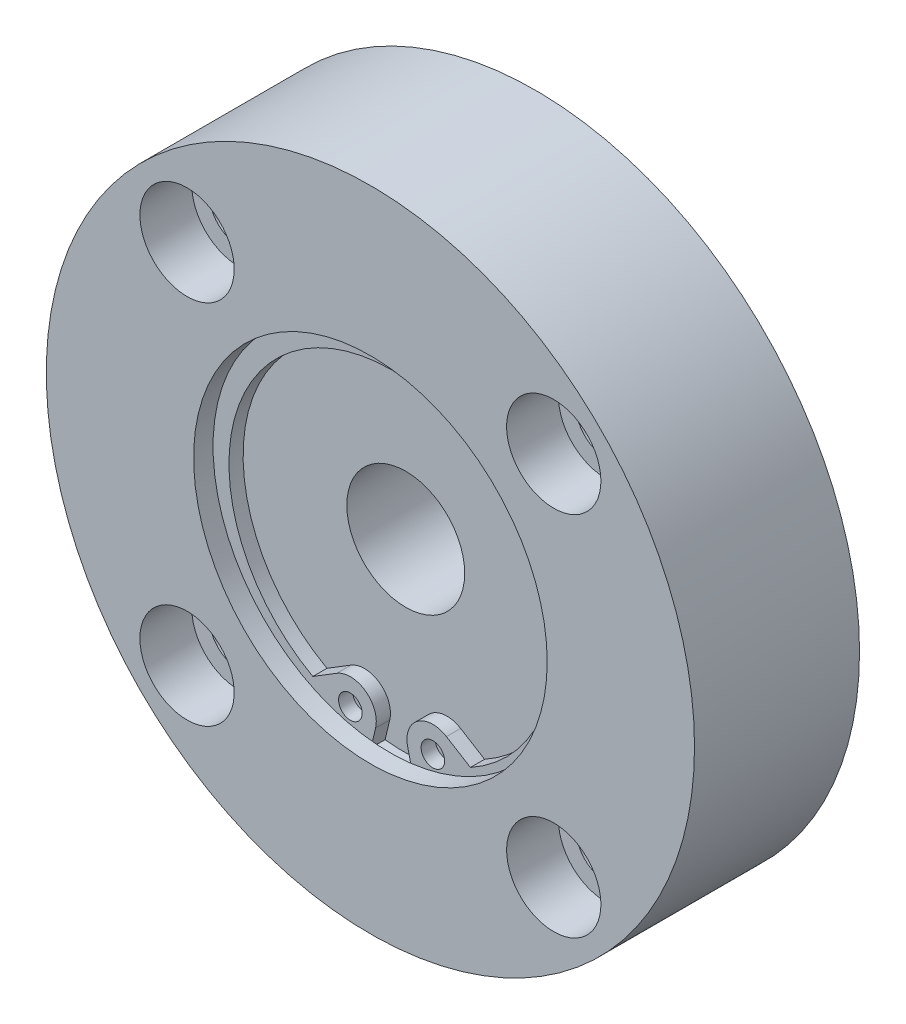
ISO-10303-21;
HEADER;
FILE_DESCRIPTION(('STEP AP214'),'2;1');
FILE_NAME('part.step','',(''),(''),'','','');
FILE_SCHEMA(('AUTOMOTIVE_DESIGN { 1 0 10303 214 1 1 1 1 }'));
ENDSEC;
DATA;
#1=APPLICATION_CONTEXT('core data for automotive mechanical design processes');
#2=APPLICATION_PROTOCOL_DEFINITION('international standard','automotive_design',2000,#1);
#3=PRODUCT_CONTEXT('',#1,'mechanical');
#4=PRODUCT('Part','Part','',(#3));
#5=PRODUCT_RELATED_PRODUCT_CATEGORY('part','',(#4));
#6=PRODUCT_DEFINITION_FORMATION('','',#4);
#7=PRODUCT_DEFINITION_CONTEXT('part definition',#1,'design');
#8=PRODUCT_DEFINITION('design','',#6,#7);
#9=PRODUCT_DEFINITION_SHAPE('','',#8);
#10=(LENGTH_UNIT() NAMED_UNIT(*) SI_UNIT(.MILLI.,.METRE.));
#11=(NAMED_UNIT(*) PLANE_ANGLE_UNIT() SI_UNIT($,.RADIAN.));
#12=(NAMED_UNIT(*) SI_UNIT($,.STERADIAN.) SOLID_ANGLE_UNIT());
#13=UNCERTAINTY_MEASURE_WITH_UNIT(LENGTH_MEASURE(1.E-05),#10,'distance_accuracy_value','');
#14=(GEOMETRIC_REPRESENTATION_CONTEXT(3) GLOBAL_UNCERTAINTY_ASSIGNED_CONTEXT((#13)) GLOBAL_UNIT_ASSIGNED_CONTEXT((#10,
#11,#12)) REPRESENTATION_CONTEXT('',''));
#15=CARTESIAN_POINT('',(0.,0.,0.));
#16=DIRECTION('',(0.,0.,1.));
#17=DIRECTION('',(1.,0.,0.));
#18=AXIS2_PLACEMENT_3D('',#15,#16,#17);
#19=CARTESIAN_POINT('',(0.,0.,11.));
#20=DIRECTION('',(0.,0.,1.));
#21=DIRECTION('',(1.,0.,0.));
#22=AXIS2_PLACEMENT_3D('',#19,#20,#21);
#23=PLANE('',#22);
#24=CARTESIAN_POINT('',(3.5,-13.4449694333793,11.));
#25=DIRECTION('',(0.,0.,1.));
#26=DIRECTION('',(1.,0.,0.));
#27=AXIS2_PLACEMENT_3D('',#24,#25,#26);
#28=CIRCLE('',#27,1.);
#29=CARTESIAN_POINT('',(4.5,-13.4449694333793,11.));
#30=VERTEX_POINT('',#29);
#31=EDGE_CURVE('E116',#30,#30,#28,.T.);
#32=ORIENTED_EDGE('',*,*,#31,.T.);
#33=EDGE_LOOP('',(#32));
#34=FACE_BOUND('',#33,.T.);
#35=ADVANCED_FACE('F14',(#34),#23,.T.);
#36=CARTESIAN_POINT('',(-3.5,-13.4449694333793,11.));
#37=DIRECTION('',(0.,0.,-1.));
#38=DIRECTION('',(1.,0.,0.));
#39=AXIS2_PLACEMENT_3D('',#36,#37,#38);
#40=CIRCLE('',#39,1.);
#41=CARTESIAN_POINT('',(-2.5,-13.4449694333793,11.));
#42=VERTEX_POINT('',#41);
#43=EDGE_CURVE('E155',#42,#42,#40,.T.);
#44=ORIENTED_EDGE('',*,*,#43,.F.);
#45=EDGE_LOOP('',(#44));
#46=FACE_BOUND('',#45,.T.);
#47=ADVANCED_FACE('F293',(#46),#23,.T.);
#48=CARTESIAN_POINT('',(15.556349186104,15.5563491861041,9.6));
#49=DIRECTION('',(0.,0.,1.));
#50=DIRECTION('',(1.,0.,0.));
#51=AXIS2_PLACEMENT_3D('',#48,#49,#50);
#52=PLANE('',#51);
#53=CARTESIAN_POINT('',(15.556349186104,15.5563491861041,9.6));
#54=DIRECTION('',(0.,0.,1.));
#55=DIRECTION('',(1.,0.,0.));
#56=AXIS2_PLACEMENT_3D('',#53,#54,#55);
#57=CIRCLE('',#56,4.);
#58=CARTESIAN_POINT('',(19.556349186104,15.5563491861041,9.6));
#59=VERTEX_POINT('',#58);
#60=EDGE_CURVE('E244',#59,#59,#57,.T.);
#61=ORIENTED_EDGE('',*,*,#60,.T.);
#62=EDGE_LOOP('',(#61));
#63=FACE_BOUND('',#62,.T.);
#64=CARTESIAN_POINT('',(15.556349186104,15.5563491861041,9.6));
#65=DIRECTION('',(0.,0.,1.));
#66=DIRECTION('',(1.,0.,0.));
#67=AXIS2_PLACEMENT_3D('',#64,#65,#66);
#68=CIRCLE('',#67,2.5);
#69=CARTESIAN_POINT('',(18.056349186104,15.5563491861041,9.6));
#70=VERTEX_POINT('',#69);
#71=EDGE_CURVE('E247',#70,#70,#68,.F.);
#72=ORIENTED_EDGE('',*,*,#71,.T.);
#73=EDGE_LOOP('',(#72));
#74=FACE_BOUND('',#73,.T.);
#75=ADVANCED_FACE('F299',(#63,#74),#52,.T.);
#76=CARTESIAN_POINT('',(15.556349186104,-15.556349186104,9.6));
#77=DIRECTION('',(0.,0.,1.));
#78=DIRECTION('',(0.,-1.,0.));
#79=AXIS2_PLACEMENT_3D('',#76,#77,#78);
#80=PLANE('',#79);
#81=CARTESIAN_POINT('',(15.556349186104,-15.556349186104,9.6));
#82=DIRECTION('',(0.,0.,1.));
#83=DIRECTION('',(0.,-1.,0.));
#84=AXIS2_PLACEMENT_3D('',#81,#82,#83);
#85=CIRCLE('',#84,4.);
#86=CARTESIAN_POINT('',(15.556349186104,-19.556349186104,9.6));
#87=VERTEX_POINT('',#86);
#88=EDGE_CURVE('E228',#87,#87,#85,.T.);
#89=ORIENTED_EDGE('',*,*,#88,.T.);
#90=EDGE_LOOP('',(#89));
#91=FACE_BOUND('',#90,.T.);
#92=CARTESIAN_POINT('',(15.556349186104,-15.556349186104,9.6));
#93=DIRECTION('',(0.,0.,1.));
#94=DIRECTION('',(1.,0.,0.));
#95=AXIS2_PLACEMENT_3D('',#92,#93,#94);
#96=CIRCLE('',#95,2.5);
#97=CARTESIAN_POINT('',(18.056349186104,-15.556349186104,9.6));
#98=VERTEX_POINT('',#97);
#99=EDGE_CURVE('E231',#98,#98,#96,.F.);
#100=ORIENTED_EDGE('',*,*,#99,.T.);
#101=EDGE_LOOP('',(#100));
#102=FACE_BOUND('',#101,.T.);
#103=ADVANCED_FACE('F569',(#91,#102),#80,.T.);
#104=CARTESIAN_POINT('',(-15.5563491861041,-15.556349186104,9.6));
#105=DIRECTION('',(0.,0.,1.));
#106=DIRECTION('',(-1.,0.,0.));
#107=AXIS2_PLACEMENT_3D('',#104,#105,#106);
#108=PLANE('',#107);
#109=CARTESIAN_POINT('',(-15.5563491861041,-15.556349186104,9.6));
#110=DIRECTION('',(0.,0.,1.));
#111=DIRECTION('',(-1.,0.,0.));
#112=AXIS2_PLACEMENT_3D('',#109,#110,#111);
#113=CIRCLE('',#112,4.);
#114=CARTESIAN_POINT('',(-19.5563491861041,-15.556349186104,9.6));
#115=VERTEX_POINT('',#114);
#116=EDGE_CURVE('E221',#115,#115,#113,.T.);
#117=ORIENTED_EDGE('',*,*,#116,.T.);
#118=EDGE_LOOP('',(#117));
#119=FACE_BOUND('',#118,.T.);
#120=CARTESIAN_POINT('',(-15.5563491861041,-15.556349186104,9.6));
#121=DIRECTION('',(0.,0.,1.));
#122=DIRECTION('',(1.,0.,0.));
#123=AXIS2_PLACEMENT_3D('',#120,#121,#122);
#124=CIRCLE('',#123,2.5);
#125=CARTESIAN_POINT('',(-13.0563491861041,-15.556349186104,9.6));
#126=VERTEX_POINT('',#125);
#127=EDGE_CURVE('E224',#126,#126,#124,.F.);
#128=ORIENTED_EDGE('',*,*,#127,.T.);
#129=EDGE_LOOP('',(#128));
#130=FACE_BOUND('',#129,.T.);
#131=ADVANCED_FACE('F560',(#119,#130),#108,.T.);
#132=CARTESIAN_POINT('',(-15.556349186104,15.5563491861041,9.6));
#133=DIRECTION('',(0.,0.,1.));
#134=DIRECTION('',(0.,1.,0.));
#135=AXIS2_PLACEMENT_3D('',#132,#133,#134);
#136=PLANE('',#135);
#137=CARTESIAN_POINT('',(-15.556349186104,15.5563491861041,9.6));
#138=DIRECTION('',(0.,0.,1.));
#139=DIRECTION('',(0.,1.,0.));
#140=AXIS2_PLACEMENT_3D('',#137,#138,#139);
#141=CIRCLE('',#140,4.);
#142=CARTESIAN_POINT('',(-15.5563491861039,19.5563491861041,9.6));
#143=VERTEX_POINT('',#142);
#144=EDGE_CURVE('E214',#143,#143,#141,.T.);
#145=ORIENTED_EDGE('',*,*,#144,.T.);
#146=EDGE_LOOP('',(#145));
#147=FACE_BOUND('',#146,.T.);
#148=CARTESIAN_POINT('',(-15.556349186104,15.5563491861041,9.6));
#149=DIRECTION('',(0.,0.,1.));
#150=DIRECTION('',(1.,0.,0.));
#151=AXIS2_PLACEMENT_3D('',#148,#149,#150);
#152=CIRCLE('',#151,2.5);
#153=CARTESIAN_POINT('',(-13.056349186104,15.5563491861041,9.6));
#154=VERTEX_POINT('',#153);
#155=EDGE_CURVE('E217',#154,#154,#152,.F.);
#156=ORIENTED_EDGE('',*,*,#155,.T.);
#157=EDGE_LOOP('',(#156));
#158=FACE_BOUND('',#157,.T.);
#159=ADVANCED_FACE('F551',(#147,#158),#136,.T.);
#160=CARTESIAN_POINT('',(15.556349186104,15.5563491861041,0.));
#161=DIRECTION('',(0.,0.,1.));
#162=DIRECTION('',(1.,0.,0.));
#163=AXIS2_PLACEMENT_3D('',#160,#161,#162);
#164=CYLINDRICAL_SURFACE('',#163,2.5);
#165=CARTESIAN_POINT('',(15.556349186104,15.5563491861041,0.));
#166=DIRECTION('',(0.,0.,1.));
#167=DIRECTION('',(1.,0.,0.));
#168=AXIS2_PLACEMENT_3D('',#165,#166,#167);
#169=CIRCLE('',#168,2.5);
#170=CARTESIAN_POINT('',(18.056349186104,15.5563491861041,0.));
#171=VERTEX_POINT('',#170);
#172=EDGE_CURVE('E248',#171,#171,#169,.T.);
#173=ORIENTED_EDGE('',*,*,#172,.F.);
#174=EDGE_LOOP('',(#173));
#175=FACE_BOUND('',#174,.T.);
#176=ORIENTED_EDGE('',*,*,#71,.F.);
#177=EDGE_LOOP('',(#176));
#178=FACE_BOUND('',#177,.T.);
#179=ADVANCED_FACE('F542',(#175,#178),#164,.F.);
#180=CARTESIAN_POINT('',(15.556349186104,-15.556349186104,0.));
#181=DIRECTION('',(0.,0.,1.));
#182=DIRECTION('',(1.,0.,0.));
#183=AXIS2_PLACEMENT_3D('',#180,#181,#182);
#184=CYLINDRICAL_SURFACE('',#183,2.5);
#185=CARTESIAN_POINT('',(15.556349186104,-15.556349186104,0.));
#186=DIRECTION('',(0.,0.,1.));
#187=DIRECTION('',(0.,-1.,0.));
#188=AXIS2_PLACEMENT_3D('',#185,#186,#187);
#189=CIRCLE('',#188,2.5);
#190=CARTESIAN_POINT('',(15.556349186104,-18.056349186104,0.));
#191=VERTEX_POINT('',#190);
#192=EDGE_CURVE('E238',#191,#191,#189,.T.);
#193=ORIENTED_EDGE('',*,*,#192,.F.);
#194=EDGE_LOOP('',(#193));
#195=FACE_BOUND('',#194,.T.);
#196=ORIENTED_EDGE('',*,*,#99,.F.);
#197=EDGE_LOOP('',(#196));
#198=FACE_BOUND('',#197,.T.);
#199=ADVANCED_FACE('F533',(#195,#198),#184,.F.);
#200=CARTESIAN_POINT('',(-15.5563491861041,-15.556349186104,0.));
#201=DIRECTION('',(0.,0.,1.));
#202=DIRECTION('',(1.,0.,0.));
#203=AXIS2_PLACEMENT_3D('',#200,#201,#202);
#204=CYLINDRICAL_SURFACE('',#203,2.5);
#205=CARTESIAN_POINT('',(-15.5563491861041,-15.556349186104,0.));
#206=DIRECTION('',(0.,0.,1.));
#207=DIRECTION('',(-1.,0.,0.));
#208=AXIS2_PLACEMENT_3D('',#205,#206,#207);
#209=CIRCLE('',#208,2.5);
#210=CARTESIAN_POINT('',(-18.0563491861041,-15.556349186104,0.));
#211=VERTEX_POINT('',#210);
#212=EDGE_CURVE('E235',#211,#211,#209,.T.);
#213=ORIENTED_EDGE('',*,*,#212,.F.);
#214=EDGE_LOOP('',(#213));
#215=FACE_BOUND('',#214,.T.);
#216=ORIENTED_EDGE('',*,*,#127,.F.);
#217=EDGE_LOOP('',(#216));
#218=FACE_BOUND('',#217,.T.);
#219=ADVANCED_FACE('F524',(#215,#218),#204,.F.);
#220=CARTESIAN_POINT('',(-15.556349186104,15.5563491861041,0.));
#221=DIRECTION('',(0.,0.,1.));
#222=DIRECTION('',(1.,0.,0.));
#223=AXIS2_PLACEMENT_3D('',#220,#221,#222);
#224=CYLINDRICAL_SURFACE('',#223,2.5);
#225=CARTESIAN_POINT('',(-15.556349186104,15.5563491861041,0.));
#226=DIRECTION('',(0.,0.,1.));
#227=DIRECTION('',(0.,1.,0.));
#228=AXIS2_PLACEMENT_3D('',#225,#226,#227);
#229=CIRCLE('',#228,2.5);
#230=CARTESIAN_POINT('',(-15.5563491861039,18.0563491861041,0.));
#231=VERTEX_POINT('',#230);
#232=EDGE_CURVE('E232',#231,#231,#229,.T.);
#233=ORIENTED_EDGE('',*,*,#232,.F.);
#234=EDGE_LOOP('',(#233));
#235=FACE_BOUND('',#234,.T.);
#236=ORIENTED_EDGE('',*,*,#155,.F.);
#237=EDGE_LOOP('',(#236));
#238=FACE_BOUND('',#237,.T.);
#239=ADVANCED_FACE('F516',(#235,#238),#224,.F.);
#240=CARTESIAN_POINT('',(0.,0.,14.));
#241=DIRECTION('',(0.,0.,-1.));
#242=DIRECTION('',(-1.,0.,0.));
#243=AXIS2_PLACEMENT_3D('',#240,#241,#242);
#244=CYLINDRICAL_SURFACE('',#243,27.5);
#245=CARTESIAN_POINT('',(0.,0.,14.));
#246=DIRECTION('',(0.,0.,1.));
#247=DIRECTION('',(1.,0.,0.));
#248=AXIS2_PLACEMENT_3D('',#245,#246,#247);
#249=CIRCLE('',#248,27.5);
#250=CARTESIAN_POINT('',(27.5,0.,14.));
#251=VERTEX_POINT('',#250);
#252=EDGE_CURVE('E156',#251,#251,#249,.T.);
#253=ORIENTED_EDGE('',*,*,#252,.F.);
#254=EDGE_LOOP('',(#253));
#255=FACE_BOUND('',#254,.T.);
#256=CARTESIAN_POINT('',(0.,0.,0.));
#257=DIRECTION('',(0.,0.,1.));
#258=DIRECTION('',(1.,0.,0.));
#259=AXIS2_PLACEMENT_3D('',#256,#257,#258);
#260=CIRCLE('',#259,27.5);
#261=CARTESIAN_POINT('',(27.5,0.,0.));
#262=VERTEX_POINT('',#261);
#263=EDGE_CURVE('E251',#262,#262,#260,.T.);
#264=ORIENTED_EDGE('',*,*,#263,.T.);
#265=EDGE_LOOP('',(#264));
#266=FACE_BOUND('',#265,.T.);
#267=ADVANCED_FACE('F16',(#255,#266),#244,.T.);
#268=CARTESIAN_POINT('',(15.556349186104,15.5563491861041,9.6));
#269=DIRECTION('',(0.,0.,1.));
#270=DIRECTION('',(1.,0.,0.));
#271=AXIS2_PLACEMENT_3D('',#268,#269,#270);
#272=CYLINDRICAL_SURFACE('',#271,4.);
#273=ORIENTED_EDGE('',*,*,#60,.F.);
#274=EDGE_LOOP('',(#273));
#275=FACE_BOUND('',#274,.T.);
#276=CARTESIAN_POINT('',(15.556349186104,15.5563491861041,14.));
#277=DIRECTION('',(0.,0.,1.));
#278=DIRECTION('',(1.,0.,0.));
#279=AXIS2_PLACEMENT_3D('',#276,#277,#278);
#280=CIRCLE('',#279,4.);
#281=CARTESIAN_POINT('',(19.556349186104,15.5563491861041,14.));
#282=VERTEX_POINT('',#281);
#283=EDGE_CURVE('E241',#282,#282,#280,.T.);
#284=ORIENTED_EDGE('',*,*,#283,.T.);
#285=EDGE_LOOP('',(#284));
#286=FACE_BOUND('',#285,.T.);
#287=ADVANCED_FACE('F499',(#275,#286),#272,.F.);
#288=CARTESIAN_POINT('',(15.556349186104,-15.556349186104,9.6));
#289=DIRECTION('',(0.,0.,1.));
#290=DIRECTION('',(1.,0.,0.));
#291=AXIS2_PLACEMENT_3D('',#288,#289,#290);
#292=CYLINDRICAL_SURFACE('',#291,4.);
#293=ORIENTED_EDGE('',*,*,#88,.F.);
#294=EDGE_LOOP('',(#293));
#295=FACE_BOUND('',#294,.T.);
#296=CARTESIAN_POINT('',(15.556349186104,-15.556349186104,14.));
#297=DIRECTION('',(0.,0.,1.));
#298=DIRECTION('',(0.,-1.,0.));
#299=AXIS2_PLACEMENT_3D('',#296,#297,#298);
#300=CIRCLE('',#299,4.);
#301=CARTESIAN_POINT('',(15.556349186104,-19.556349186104,14.));
#302=VERTEX_POINT('',#301);
#303=EDGE_CURVE('E225',#302,#302,#300,.T.);
#304=ORIENTED_EDGE('',*,*,#303,.T.);
#305=EDGE_LOOP('',(#304));
#306=FACE_BOUND('',#305,.T.);
#307=ADVANCED_FACE('F490',(#295,#306),#292,.F.);
#308=CARTESIAN_POINT('',(-15.5563491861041,-15.556349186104,9.6));
#309=DIRECTION('',(0.,0.,1.));
#310=DIRECTION('',(1.,0.,0.));
#311=AXIS2_PLACEMENT_3D('',#308,#309,#310);
#312=CYLINDRICAL_SURFACE('',#311,4.);
#313=ORIENTED_EDGE('',*,*,#116,.F.);
#314=EDGE_LOOP('',(#313));
#315=FACE_BOUND('',#314,.T.);
#316=CARTESIAN_POINT('',(-15.5563491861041,-15.556349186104,14.));
#317=DIRECTION('',(0.,0.,1.));
#318=DIRECTION('',(-1.,0.,0.));
#319=AXIS2_PLACEMENT_3D('',#316,#317,#318);
#320=CIRCLE('',#319,4.);
#321=CARTESIAN_POINT('',(-19.5563491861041,-15.556349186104,14.));
#322=VERTEX_POINT('',#321);
#323=EDGE_CURVE('E218',#322,#322,#320,.T.);
#324=ORIENTED_EDGE('',*,*,#323,.T.);
#325=EDGE_LOOP('',(#324));
#326=FACE_BOUND('',#325,.T.);
#327=ADVANCED_FACE('F481',(#315,#326),#312,.F.);
#328=CARTESIAN_POINT('',(-15.556349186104,15.5563491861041,9.6));
#329=DIRECTION('',(0.,0.,1.));
#330=DIRECTION('',(1.,0.,0.));
#331=AXIS2_PLACEMENT_3D('',#328,#329,#330);
#332=CYLINDRICAL_SURFACE('',#331,4.);
#333=ORIENTED_EDGE('',*,*,#144,.F.);
#334=EDGE_LOOP('',(#333));
#335=FACE_BOUND('',#334,.T.);
#336=CARTESIAN_POINT('',(-15.556349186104,15.5563491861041,14.));
#337=DIRECTION('',(0.,0.,1.));
#338=DIRECTION('',(0.,1.,0.));
#339=AXIS2_PLACEMENT_3D('',#336,#337,#338);
#340=CIRCLE('',#339,4.);
#341=CARTESIAN_POINT('',(-15.5563491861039,19.5563491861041,14.));
#342=VERTEX_POINT('',#341);
#343=EDGE_CURVE('E211',#342,#342,#340,.T.);
#344=ORIENTED_EDGE('',*,*,#343,.T.);
#345=EDGE_LOOP('',(#344));
#346=FACE_BOUND('',#345,.T.);
#347=ADVANCED_FACE('F472',(#335,#346),#332,.F.);
#348=CARTESIAN_POINT('',(0.,0.,0.));
#349=DIRECTION('',(0.,0.,1.));
#350=DIRECTION('',(1.,0.,0.));
#351=AXIS2_PLACEMENT_3D('',#348,#349,#350);
#352=PLANE('',#351);
#353=CARTESIAN_POINT('',(0.,0.,0.));
#354=DIRECTION('',(0.,0.,-1.));
#355=DIRECTION('',(-1.,0.,0.));
#356=AXIS2_PLACEMENT_3D('',#353,#354,#355);
#357=CIRCLE('',#356,12.);
#358=CARTESIAN_POINT('',(-12.,0.,0.));
#359=VERTEX_POINT('',#358);
#360=EDGE_CURVE('E200',#359,#359,#357,.T.);
#361=ORIENTED_EDGE('',*,*,#360,.F.);
#362=EDGE_LOOP('',(#361));
#363=FACE_BOUND('',#362,.T.);
#364=ORIENTED_EDGE('',*,*,#232,.T.);
#365=EDGE_LOOP('',(#364));
#366=FACE_BOUND('',#365,.T.);
#367=ORIENTED_EDGE('',*,*,#212,.T.);
#368=EDGE_LOOP('',(#367));
#369=FACE_BOUND('',#368,.T.);
#370=ORIENTED_EDGE('',*,*,#192,.T.);
#371=EDGE_LOOP('',(#370));
#372=FACE_BOUND('',#371,.T.);
#373=ORIENTED_EDGE('',*,*,#172,.T.);
#374=EDGE_LOOP('',(#373));
#375=FACE_BOUND('',#374,.T.);
#376=ORIENTED_EDGE('',*,*,#263,.F.);
#377=EDGE_LOOP('',(#376));
#378=FACE_BOUND('',#377,.T.);
#379=ADVANCED_FACE('F464',(#363,#366,#369,#372,#375,#378),#352,.F.);
#380=CARTESIAN_POINT('',(0.,0.,14.));
#381=DIRECTION('',(0.,0.,1.));
#382=DIRECTION('',(1.,0.,0.));
#383=AXIS2_PLACEMENT_3D('',#380,#381,#382);
#384=PLANE('',#383);
#385=CARTESIAN_POINT('',(0.,0.,14.));
#386=DIRECTION('',(0.,0.,1.));
#387=DIRECTION('',(1.,0.,0.));
#388=AXIS2_PLACEMENT_3D('',#385,#386,#387);
#389=CIRCLE('',#388,15.);
#390=CARTESIAN_POINT('',(15.,0.,14.));
#391=VERTEX_POINT('',#390);
#392=EDGE_CURVE('E207',#391,#391,#389,.T.);
#393=ORIENTED_EDGE('',*,*,#392,.F.);
#394=EDGE_LOOP('',(#393));
#395=FACE_BOUND('',#394,.T.);
#396=ORIENTED_EDGE('',*,*,#343,.F.);
#397=EDGE_LOOP('',(#396));
#398=FACE_BOUND('',#397,.T.);
#399=ORIENTED_EDGE('',*,*,#323,.F.);
#400=EDGE_LOOP('',(#399));
#401=FACE_BOUND('',#400,.T.);
#402=ORIENTED_EDGE('',*,*,#303,.F.);
#403=EDGE_LOOP('',(#402));
#404=FACE_BOUND('',#403,.T.);
#405=ORIENTED_EDGE('',*,*,#283,.F.);
#406=EDGE_LOOP('',(#405));
#407=FACE_BOUND('',#406,.T.);
#408=ORIENTED_EDGE('',*,*,#252,.T.);
#409=EDGE_LOOP('',(#408));
#410=FACE_BOUND('',#409,.T.);
#411=ADVANCED_FACE('F456',(#395,#398,#401,#404,#407,#410),#384,.T.);
#412=CARTESIAN_POINT('',(0.,0.,2.));
#413=DIRECTION('',(0.,0.,-1.));
#414=DIRECTION('',(-1.,0.,0.));
#415=AXIS2_PLACEMENT_3D('',#412,#413,#414);
#416=CYLINDRICAL_SURFACE('',#415,12.);
#417=CARTESIAN_POINT('',(0.,0.,2.));
#418=DIRECTION('',(0.,0.,-1.));
#419=DIRECTION('',(-1.,0.,0.));
#420=AXIS2_PLACEMENT_3D('',#417,#418,#419);
#421=CIRCLE('',#420,12.);
#422=CARTESIAN_POINT('',(-12.,0.,2.));
#423=VERTEX_POINT('',#422);
#424=EDGE_CURVE('E203',#423,#423,#421,.T.);
#425=ORIENTED_EDGE('',*,*,#424,.F.);
#426=EDGE_LOOP('',(#425));
#427=FACE_BOUND('',#426,.T.);
#428=ORIENTED_EDGE('',*,*,#360,.T.);
#429=EDGE_LOOP('',(#428));
#430=FACE_BOUND('',#429,.T.);
#431=ADVANCED_FACE('F448',(#427,#430),#416,.F.);
#432=CARTESIAN_POINT('',(0.,0.,11.));
#433=DIRECTION('',(0.,0.,1.));
#434=DIRECTION('',(1.,0.,0.));
#435=AXIS2_PLACEMENT_3D('',#432,#433,#434);
#436=CYLINDRICAL_SURFACE('',#435,15.);
#437=CARTESIAN_POINT('',(0.,0.,12.35));
#438=DIRECTION('',(0.,0.,1.));
#439=DIRECTION('',(1.,0.,0.));
#440=AXIS2_PLACEMENT_3D('',#437,#438,#439);
#441=CIRCLE('',#440,15.);
#442=CARTESIAN_POINT('',(15.,0.,12.35));
#443=VERTEX_POINT('',#442);
#444=EDGE_CURVE('E196',#443,#443,#441,.F.);
#445=ORIENTED_EDGE('',*,*,#444,.T.);
#446=EDGE_LOOP('',(#445));
#447=FACE_BOUND('',#446,.T.);
#448=ORIENTED_EDGE('',*,*,#392,.T.);
#449=EDGE_LOOP('',(#448));
#450=FACE_BOUND('',#449,.T.);
#451=ADVANCED_FACE('F271',(#447,#450),#436,.F.);
#452=CARTESIAN_POINT('',(0.,0.,2.));
#453=DIRECTION('',(0.,0.,-1.));
#454=DIRECTION('',(-1.,0.,0.));
#455=AXIS2_PLACEMENT_3D('',#452,#453,#454);
#456=PLANE('',#455);
#457=CARTESIAN_POINT('',(0.,0.,2.));
#458=DIRECTION('',(0.,0.,-1.));
#459=DIRECTION('',(-1.,0.,0.));
#460=AXIS2_PLACEMENT_3D('',#457,#458,#459);
#461=CIRCLE('',#460,5.);
#462=CARTESIAN_POINT('',(-5.,0.,2.));
#463=VERTEX_POINT('',#462);
#464=EDGE_CURVE('E206',#463,#463,#461,.T.);
#465=ORIENTED_EDGE('',*,*,#464,.F.);
#466=EDGE_LOOP('',(#465));
#467=FACE_BOUND('',#466,.T.);
#468=ORIENTED_EDGE('',*,*,#424,.T.);
#469=EDGE_LOOP('',(#468));
#470=FACE_BOUND('',#469,.T.);
#471=ADVANCED_FACE('F277',(#467,#470),#456,.T.);
#472=CARTESIAN_POINT('',(0.,0.,12.35));
#473=DIRECTION('',(0.,0.,1.));
#474=DIRECTION('',(1.,0.,0.));
#475=AXIS2_PLACEMENT_3D('',#472,#473,#474);
#476=PLANE('',#475);
#477=CARTESIAN_POINT('',(0.,0.,12.35));
#478=DIRECTION('',(0.,0.,1.));
#479=DIRECTION('',(1.,0.,0.));
#480=AXIS2_PLACEMENT_3D('',#477,#478,#479);
#481=CIRCLE('',#480,15.7);
#482=CARTESIAN_POINT('',(15.7,0.,12.35));
#483=VERTEX_POINT('',#482);
#484=EDGE_CURVE('E193',#483,#483,#481,.T.);
#485=ORIENTED_EDGE('',*,*,#484,.F.);
#486=EDGE_LOOP('',(#485));
#487=FACE_BOUND('',#486,.T.);
#488=ORIENTED_EDGE('',*,*,#444,.F.);
#489=EDGE_LOOP('',(#488));
#490=FACE_BOUND('',#489,.T.);
#491=ADVANCED_FACE('F274',(#487,#490),#476,.F.);
#492=CARTESIAN_POINT('',(0.,0.,12.35));
#493=DIRECTION('',(0.,0.,-1.));
#494=DIRECTION('',(-1.,0.,0.));
#495=AXIS2_PLACEMENT_3D('',#492,#493,#494);
#496=CYLINDRICAL_SURFACE('',#495,15.7);
#497=ORIENTED_EDGE('',*,*,#484,.T.);
#498=EDGE_LOOP('',(#497));
#499=FACE_BOUND('',#498,.T.);
#500=DIRECTION('',(0.,0.,-1.));
#501=VECTOR('',#500,1.);
#502=CARTESIAN_POINT('',(1.75159098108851,-15.6019847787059,12.35));
#503=LINE('',#502,#501);
#504=CARTESIAN_POINT('',(1.75159098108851,-15.6019847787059,11.));
#505=VERTEX_POINT('',#504);
#506=CARTESIAN_POINT('',(1.75159098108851,-15.6019847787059,12.2));
#507=VERTEX_POINT('',#506);
#508=EDGE_CURVE('E18',#505,#507,#503,.F.);
#509=ORIENTED_EDGE('',*,*,#508,.F.);
#510=CARTESIAN_POINT('',(0.,0.,11.));
#511=DIRECTION('',(0.,0.,1.));
#512=DIRECTION('',(1.,0.,0.));
#513=AXIS2_PLACEMENT_3D('',#510,#511,#512);
#514=CIRCLE('',#513,15.7);
#515=CARTESIAN_POINT('',(-1.7515909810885,-15.6019847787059,11.));
#516=VERTEX_POINT('',#515);
#517=EDGE_CURVE('E197',#516,#505,#514,.T.);
#518=ORIENTED_EDGE('',*,*,#517,.F.);
#519=DIRECTION('',(0.,0.,-1.));
#520=VECTOR('',#519,1.);
#521=CARTESIAN_POINT('',(-1.7515909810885,-15.6019847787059,12.35));
#522=LINE('',#521,#520);
#523=CARTESIAN_POINT('',(-1.7515909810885,-15.6019847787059,12.2));
#524=VERTEX_POINT('',#523);
#525=EDGE_CURVE('E105',#524,#516,#522,.T.);
#526=ORIENTED_EDGE('',*,*,#525,.F.);
#527=CARTESIAN_POINT('',(0.,0.,12.2));
#528=DIRECTION('',(0.,0.,-1.));
#529=DIRECTION('',(-1.,0.,0.));
#530=AXIS2_PLACEMENT_3D('',#527,#528,#529);
#531=CIRCLE('',#530,15.7);
#532=EDGE_CURVE('E9',#507,#524,#531,.F.);
#533=ORIENTED_EDGE('',*,*,#532,.F.);
#534=EDGE_LOOP('',(#509,#518,#526,#533));
#535=FACE_BOUND('',#534,.T.);
#536=ADVANCED_FACE('F276',(#499,#535),#496,.F.);
#537=CARTESIAN_POINT('',(0.,0.,14.));
#538=DIRECTION('',(0.,0.,-1.));
#539=DIRECTION('',(-1.,0.,0.));
#540=AXIS2_PLACEMENT_3D('',#537,#538,#539);
#541=CYLINDRICAL_SURFACE('',#540,5.);
#542=CARTESIAN_POINT('',(0.,0.,11.));
#543=DIRECTION('',(0.,0.,1.));
#544=DIRECTION('',(1.,0.,0.));
#545=AXIS2_PLACEMENT_3D('',#542,#543,#544);
#546=CIRCLE('',#545,5.);
#547=CARTESIAN_POINT('',(5.,0.,11.));
#548=VERTEX_POINT('',#547);
#549=EDGE_CURVE('E210',#548,#548,#546,.T.);
#550=ORIENTED_EDGE('',*,*,#549,.T.);
#551=EDGE_LOOP('',(#550));
#552=FACE_BOUND('',#551,.T.);
#553=ORIENTED_EDGE('',*,*,#464,.T.);
#554=EDGE_LOOP('',(#553));
#555=FACE_BOUND('',#554,.T.);
#556=ADVANCED_FACE('F285',(#552,#555),#541,.F.);
#557=ORIENTED_EDGE('',*,*,#549,.F.);
#558=EDGE_LOOP('',(#557));
#559=FACE_BOUND('',#558,.T.);
#560=DIRECTION('',(0.231349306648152,-0.972870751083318,0.));
#561=VECTOR('',#560,1.);
#562=CARTESIAN_POINT('',(1.35968434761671,-13.9539379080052,11.));
#563=LINE('',#562,#561);
#564=CARTESIAN_POINT('',(1.35968434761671,-13.9539379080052,11.));
#565=VERTEX_POINT('',#564);
#566=EDGE_CURVE('E34',#565,#505,#563,.T.);
#567=ORIENTED_EDGE('',*,*,#566,.F.);
#568=CARTESIAN_POINT('',(3.5,-13.4449694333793,11.));
#569=DIRECTION('',(0.,0.,1.));
#570=DIRECTION('',(1.,0.,0.));
#571=AXIS2_PLACEMENT_3D('',#568,#569,#570);
#572=CIRCLE('',#571,2.2);
#573=CARTESIAN_POINT('',(4.6535366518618,-11.5716426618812,11.));
#574=VERTEX_POINT('',#573);
#575=EDGE_CURVE('E137',#574,#565,#572,.T.);
#576=ORIENTED_EDGE('',*,*,#575,.F.);
#577=DIRECTION('',(-0.851512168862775,0.524334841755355,0.));
#578=VECTOR('',#577,1.);
#579=CARTESIAN_POINT('',(4.6535366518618,-11.5716426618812,11.));
#580=LINE('',#579,#578);
#581=CARTESIAN_POINT('',(6.68514847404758,-12.8226463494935,11.));
#582=VERTEX_POINT('',#581);
#583=EDGE_CURVE('E111',#582,#574,#580,.T.);
#584=ORIENTED_EDGE('',*,*,#583,.F.);
#585=CARTESIAN_POINT('',(0.,-0.75,11.));
#586=DIRECTION('',(0.,0.,-1.));
#587=DIRECTION('',(0.,-1.,0.));
#588=AXIS2_PLACEMENT_3D('',#585,#586,#587);
#589=CIRCLE('',#588,13.8);
#590=CARTESIAN_POINT('',(-6.68514847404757,-12.8226463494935,11.));
#591=VERTEX_POINT('',#590);
#592=EDGE_CURVE('E108',#591,#582,#589,.T.);
#593=ORIENTED_EDGE('',*,*,#592,.F.);
#594=DIRECTION('',(-0.851512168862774,-0.524334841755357,0.));
#595=VECTOR('',#594,1.);
#596=CARTESIAN_POINT('',(-4.65353665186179,-11.5716426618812,11.));
#597=LINE('',#596,#595);
#598=CARTESIAN_POINT('',(-4.65353665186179,-11.5716426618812,11.));
#599=VERTEX_POINT('',#598);
#600=EDGE_CURVE('E94',#599,#591,#597,.T.);
#601=ORIENTED_EDGE('',*,*,#600,.F.);
#602=CARTESIAN_POINT('',(-3.5,-13.4449694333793,11.));
#603=DIRECTION('',(0.,0.,1.));
#604=DIRECTION('',(-1.,0.,0.));
#605=AXIS2_PLACEMENT_3D('',#602,#603,#604);
#606=CIRCLE('',#605,2.2);
#607=CARTESIAN_POINT('',(-1.3596843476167,-13.9539379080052,11.));
#608=VERTEX_POINT('',#607);
#609=EDGE_CURVE('E157',#608,#599,#606,.T.);
#610=ORIENTED_EDGE('',*,*,#609,.F.);
#611=DIRECTION('',(0.231349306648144,0.97287075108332,0.));
#612=VECTOR('',#611,1.);
#613=CARTESIAN_POINT('',(-1.3596843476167,-13.9539379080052,11.));
#614=LINE('',#613,#612);
#615=EDGE_CURVE('E150',#516,#608,#614,.T.);
#616=ORIENTED_EDGE('',*,*,#615,.F.);
#617=ORIENTED_EDGE('',*,*,#517,.T.);
#618=EDGE_LOOP('',(#567,#576,#584,#593,#601,#610,#616,#617));
#619=FACE_BOUND('',#618,.T.);
#620=ADVANCED_FACE('F109',(#559,#619),#23,.T.);
#621=CARTESIAN_POINT('',(0.,-0.75,12.2));
#622=DIRECTION('',(0.,0.,1.));
#623=DIRECTION('',(-1.,0.,0.));
#624=AXIS2_PLACEMENT_3D('',#621,#622,#623);
#625=CYLINDRICAL_SURFACE('',#624,13.8);
#626=ORIENTED_EDGE('',*,*,#592,.T.);
#627=DIRECTION('',(0.,0.,-1.));
#628=VECTOR('',#627,1.);
#629=CARTESIAN_POINT('',(6.68514847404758,-12.8226463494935,12.2));
#630=LINE('',#629,#628);
#631=CARTESIAN_POINT('',(6.68514847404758,-12.8226463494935,12.2));
#632=VERTEX_POINT('',#631);
#633=EDGE_CURVE('E124',#632,#582,#630,.T.);
#634=ORIENTED_EDGE('',*,*,#633,.F.);
#635=CARTESIAN_POINT('',(0.,-0.75,12.2));
#636=DIRECTION('',(0.,0.,-1.));
#637=DIRECTION('',(0.,-1.,0.));
#638=AXIS2_PLACEMENT_3D('',#635,#636,#637);
#639=CIRCLE('',#638,13.8);
#640=CARTESIAN_POINT('',(-6.68514847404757,-12.8226463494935,12.2));
#641=VERTEX_POINT('',#640);
#642=EDGE_CURVE('E119',#641,#632,#639,.T.);
#643=ORIENTED_EDGE('',*,*,#642,.F.);
#644=DIRECTION('',(0.,0.,-1.));
#645=VECTOR('',#644,1.);
#646=CARTESIAN_POINT('',(-6.68514847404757,-12.8226463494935,12.2));
#647=LINE('',#646,#645);
#648=EDGE_CURVE('E98',#641,#591,#647,.T.);
#649=ORIENTED_EDGE('',*,*,#648,.T.);
#650=EDGE_LOOP('',(#626,#634,#643,#649));
#651=FACE_BOUND('',#650,.T.);
#652=ADVANCED_FACE('F118',(#651),#625,.F.);
#653=CARTESIAN_POINT('',(4.6535366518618,-11.5716426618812,12.2));
#654=DIRECTION('',(-0.524334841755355,-0.851512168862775,0.));
#655=DIRECTION('',(-0.851512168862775,0.524334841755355,0.));
#656=AXIS2_PLACEMENT_3D('',#653,#654,#655);
#657=PLANE('',#656);
#658=ORIENTED_EDGE('',*,*,#583,.T.);
#659=DIRECTION('',(0.,0.,-1.));
#660=VECTOR('',#659,1.);
#661=CARTESIAN_POINT('',(4.6535366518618,-11.5716426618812,12.2));
#662=LINE('',#661,#660);
#663=CARTESIAN_POINT('',(4.6535366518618,-11.5716426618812,12.2));
#664=VERTEX_POINT('',#663);
#665=EDGE_CURVE('E143',#664,#574,#662,.T.);
#666=ORIENTED_EDGE('',*,*,#665,.F.);
#667=DIRECTION('',(-0.851512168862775,0.524334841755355,0.));
#668=VECTOR('',#667,1.);
#669=CARTESIAN_POINT('',(4.6535366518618,-11.5716426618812,12.2));
#670=LINE('',#669,#668);
#671=EDGE_CURVE('E146',#632,#664,#670,.T.);
#672=ORIENTED_EDGE('',*,*,#671,.F.);
#673=ORIENTED_EDGE('',*,*,#633,.T.);
#674=EDGE_LOOP('',(#658,#666,#672,#673));
#675=FACE_BOUND('',#674,.T.);
#676=ADVANCED_FACE('F307',(#675),#657,.F.);
#677=CARTESIAN_POINT('',(3.5,-13.4449694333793,12.2));
#678=DIRECTION('',(0.,0.,1.));
#679=DIRECTION('',(-1.,0.,0.));
#680=AXIS2_PLACEMENT_3D('',#677,#678,#679);
#681=CYLINDRICAL_SURFACE('',#680,2.2);
#682=ORIENTED_EDGE('',*,*,#575,.T.);
#683=DIRECTION('',(0.,0.,-1.));
#684=VECTOR('',#683,1.);
#685=CARTESIAN_POINT('',(1.35968434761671,-13.9539379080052,12.2));
#686=LINE('',#685,#684);
#687=CARTESIAN_POINT('',(1.35968434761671,-13.9539379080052,12.2));
#688=VERTEX_POINT('',#687);
#689=EDGE_CURVE('E147',#688,#565,#686,.T.);
#690=ORIENTED_EDGE('',*,*,#689,.F.);
#691=CARTESIAN_POINT('',(3.5,-13.4449694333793,12.2));
#692=DIRECTION('',(0.,0.,1.));
#693=DIRECTION('',(1.,0.,0.));
#694=AXIS2_PLACEMENT_3D('',#691,#692,#693);
#695=CIRCLE('',#694,2.2);
#696=EDGE_CURVE('E166',#664,#688,#695,.T.);
#697=ORIENTED_EDGE('',*,*,#696,.F.);
#698=ORIENTED_EDGE('',*,*,#665,.T.);
#699=EDGE_LOOP('',(#682,#690,#697,#698));
#700=FACE_BOUND('',#699,.T.);
#701=ADVANCED_FACE('F312',(#700),#681,.T.);
#702=CARTESIAN_POINT('',(-1.3596843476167,-13.9539379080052,12.2));
#703=DIRECTION('',(-0.97287075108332,0.231349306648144,0.));
#704=DIRECTION('',(0.,0.,1.));
#705=AXIS2_PLACEMENT_3D('',#702,#703,#704);
#706=PLANE('',#705);
#707=DIRECTION('',(0.231349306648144,0.97287075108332,0.));
#708=VECTOR('',#707,1.);
#709=CARTESIAN_POINT('',(-1.3596843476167,-13.9539379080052,12.2));
#710=LINE('',#709,#708);
#711=CARTESIAN_POINT('',(-1.3596843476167,-13.9539379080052,12.2));
#712=VERTEX_POINT('',#711);
#713=EDGE_CURVE('E132',#524,#712,#710,.T.);
#714=ORIENTED_EDGE('',*,*,#713,.F.);
#715=ORIENTED_EDGE('',*,*,#525,.T.);
#716=ORIENTED_EDGE('',*,*,#615,.T.);
#717=DIRECTION('',(0.,0.,-1.));
#718=VECTOR('',#717,1.);
#719=CARTESIAN_POINT('',(-1.3596843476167,-13.9539379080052,12.2));
#720=LINE('',#719,#718);
#721=EDGE_CURVE('E160',#712,#608,#720,.T.);
#722=ORIENTED_EDGE('',*,*,#721,.F.);
#723=EDGE_LOOP('',(#714,#715,#716,#722));
#724=FACE_BOUND('',#723,.T.);
#725=ADVANCED_FACE('F317',(#724),#706,.F.);
#726=CARTESIAN_POINT('',(0.,-0.75,12.2));
#727=DIRECTION('',(0.,0.,-1.));
#728=DIRECTION('',(0.,-1.,0.));
#729=AXIS2_PLACEMENT_3D('',#726,#727,#728);
#730=PLANE('',#729);
#731=CARTESIAN_POINT('',(-3.5,-13.4449694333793,12.2));
#732=DIRECTION('',(0.,0.,-1.));
#733=DIRECTION('',(1.,0.,0.));
#734=AXIS2_PLACEMENT_3D('',#731,#732,#733);
#735=CIRCLE('',#734,1.);
#736=CARTESIAN_POINT('',(-2.5,-13.4449694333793,12.2));
#737=VERTEX_POINT('',#736);
#738=EDGE_CURVE('E133',#737,#737,#735,.T.);
#739=ORIENTED_EDGE('',*,*,#738,.T.);
#740=EDGE_LOOP('',(#739));
#741=FACE_BOUND('',#740,.T.);
#742=CARTESIAN_POINT('',(3.5,-13.4449694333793,12.2));
#743=DIRECTION('',(0.,0.,1.));
#744=DIRECTION('',(1.,0.,0.));
#745=AXIS2_PLACEMENT_3D('',#742,#743,#744);
#746=CIRCLE('',#745,1.);
#747=CARTESIAN_POINT('',(4.5,-13.4449694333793,12.2));
#748=VERTEX_POINT('',#747);
#749=EDGE_CURVE('E151',#748,#748,#746,.T.);
#750=ORIENTED_EDGE('',*,*,#749,.F.);
#751=EDGE_LOOP('',(#750));
#752=FACE_BOUND('',#751,.T.);
#753=DIRECTION('',(0.231349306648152,-0.972870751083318,0.));
#754=VECTOR('',#753,1.);
#755=CARTESIAN_POINT('',(1.35968434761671,-13.9539379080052,12.2));
#756=LINE('',#755,#754);
#757=EDGE_CURVE('E170',#688,#507,#756,.T.);
#758=ORIENTED_EDGE('',*,*,#757,.T.);
#759=ORIENTED_EDGE('',*,*,#532,.T.);
#760=ORIENTED_EDGE('',*,*,#713,.T.);
#761=CARTESIAN_POINT('',(-3.5,-13.4449694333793,12.2));
#762=DIRECTION('',(0.,0.,1.));
#763=DIRECTION('',(-1.,0.,0.));
#764=AXIS2_PLACEMENT_3D('',#761,#762,#763);
#765=CIRCLE('',#764,2.2);
#766=CARTESIAN_POINT('',(-4.65353665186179,-11.5716426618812,12.2));
#767=VERTEX_POINT('',#766);
#768=EDGE_CURVE('E128',#712,#767,#765,.T.);
#769=ORIENTED_EDGE('',*,*,#768,.T.);
#770=DIRECTION('',(-0.851512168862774,-0.524334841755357,0.));
#771=VECTOR('',#770,1.);
#772=CARTESIAN_POINT('',(-4.65353665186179,-11.5716426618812,12.2));
#773=LINE('',#772,#771);
#774=EDGE_CURVE('E138',#767,#641,#773,.T.);
#775=ORIENTED_EDGE('',*,*,#774,.T.);
#776=ORIENTED_EDGE('',*,*,#642,.T.);
#777=ORIENTED_EDGE('',*,*,#671,.T.);
#778=ORIENTED_EDGE('',*,*,#696,.T.);
#779=EDGE_LOOP('',(#758,#759,#760,#769,#775,#776,#777,#778));
#780=FACE_BOUND('',#779,.T.);
#781=ADVANCED_FACE('F322',(#741,#752,#780),#730,.F.);
#782=CARTESIAN_POINT('',(3.5,-13.4449694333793,12.2));
#783=DIRECTION('',(0.,0.,1.));
#784=DIRECTION('',(-1.,0.,0.));
#785=AXIS2_PLACEMENT_3D('',#782,#783,#784);
#786=CYLINDRICAL_SURFACE('',#785,1.);
#787=ORIENTED_EDGE('',*,*,#31,.F.);
#788=EDGE_LOOP('',(#787));
#789=FACE_BOUND('',#788,.T.);
#790=ORIENTED_EDGE('',*,*,#749,.T.);
#791=EDGE_LOOP('',(#790));
#792=FACE_BOUND('',#791,.T.);
#793=ADVANCED_FACE('F324',(#789,#792),#786,.F.);
#794=CARTESIAN_POINT('',(-3.5,-13.4449694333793,12.2));
#795=DIRECTION('',(0.,0.,1.));
#796=DIRECTION('',(-1.,0.,0.));
#797=AXIS2_PLACEMENT_3D('',#794,#795,#796);
#798=CYLINDRICAL_SURFACE('',#797,1.);
#799=ORIENTED_EDGE('',*,*,#43,.T.);
#800=EDGE_LOOP('',(#799));
#801=FACE_BOUND('',#800,.T.);
#802=ORIENTED_EDGE('',*,*,#738,.F.);
#803=EDGE_LOOP('',(#802));
#804=FACE_BOUND('',#803,.T.);
#805=ADVANCED_FACE('F330',(#801,#804),#798,.F.);
#806=CARTESIAN_POINT('',(-4.65353665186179,-11.5716426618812,12.2));
#807=DIRECTION('',(0.524334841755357,-0.851512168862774,0.));
#808=DIRECTION('',(0.,0.,-1.));
#809=AXIS2_PLACEMENT_3D('',#806,#807,#808);
#810=PLANE('',#809);
#811=ORIENTED_EDGE('',*,*,#600,.T.);
#812=ORIENTED_EDGE('',*,*,#648,.F.);
#813=ORIENTED_EDGE('',*,*,#774,.F.);
#814=DIRECTION('',(0.,0.,-1.));
#815=VECTOR('',#814,1.);
#816=CARTESIAN_POINT('',(-4.65353665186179,-11.5716426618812,12.2));
#817=LINE('',#816,#815);
#818=EDGE_CURVE('E101',#767,#599,#817,.T.);
#819=ORIENTED_EDGE('',*,*,#818,.T.);
#820=EDGE_LOOP('',(#811,#812,#813,#819));
#821=FACE_BOUND('',#820,.T.);
#822=ADVANCED_FACE('F96',(#821),#810,.F.);
#823=CARTESIAN_POINT('',(-3.5,-13.4449694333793,12.2));
#824=DIRECTION('',(0.,0.,1.));
#825=DIRECTION('',(-1.,0.,0.));
#826=AXIS2_PLACEMENT_3D('',#823,#824,#825);
#827=CYLINDRICAL_SURFACE('',#826,2.2);
#828=ORIENTED_EDGE('',*,*,#609,.T.);
#829=ORIENTED_EDGE('',*,*,#818,.F.);
#830=ORIENTED_EDGE('',*,*,#768,.F.);
#831=ORIENTED_EDGE('',*,*,#721,.T.);
#832=EDGE_LOOP('',(#828,#829,#830,#831));
#833=FACE_BOUND('',#832,.T.);
#834=ADVANCED_FACE('F321',(#833),#827,.T.);
#835=CARTESIAN_POINT('',(1.35968434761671,-13.9539379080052,12.2));
#836=DIRECTION('',(0.972870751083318,0.231349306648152,0.));
#837=DIRECTION('',(0.,0.,-1.));
#838=AXIS2_PLACEMENT_3D('',#835,#836,#837);
#839=PLANE('',#838);
#840=ORIENTED_EDGE('',*,*,#566,.T.);
#841=ORIENTED_EDGE('',*,*,#508,.T.);
#842=ORIENTED_EDGE('',*,*,#757,.F.);
#843=ORIENTED_EDGE('',*,*,#689,.T.);
#844=EDGE_LOOP('',(#840,#841,#842,#843));
#845=FACE_BOUND('',#844,.T.);
#846=ADVANCED_FACE('F301',(#845),#839,.F.);
#847=CLOSED_SHELL('',(#35,#47,#75,#103,#131,#159,#179,#199,#219,#239,#267,#287,#307,#327,#347,
#379,#411,#431,#451,#471,#491,#536,#556,#620,#652,#676,#701,#725,#781,#793,#805,#822,#834,#846));
#848=MANIFOLD_SOLID_BREP('B1',#847);
#849=ADVANCED_BREP_SHAPE_REPRESENTATION('',(#18,#848),#14);
#850=SHAPE_DEFINITION_REPRESENTATION(#9,#849);
ENDSEC;
END-ISO-10303-21;
